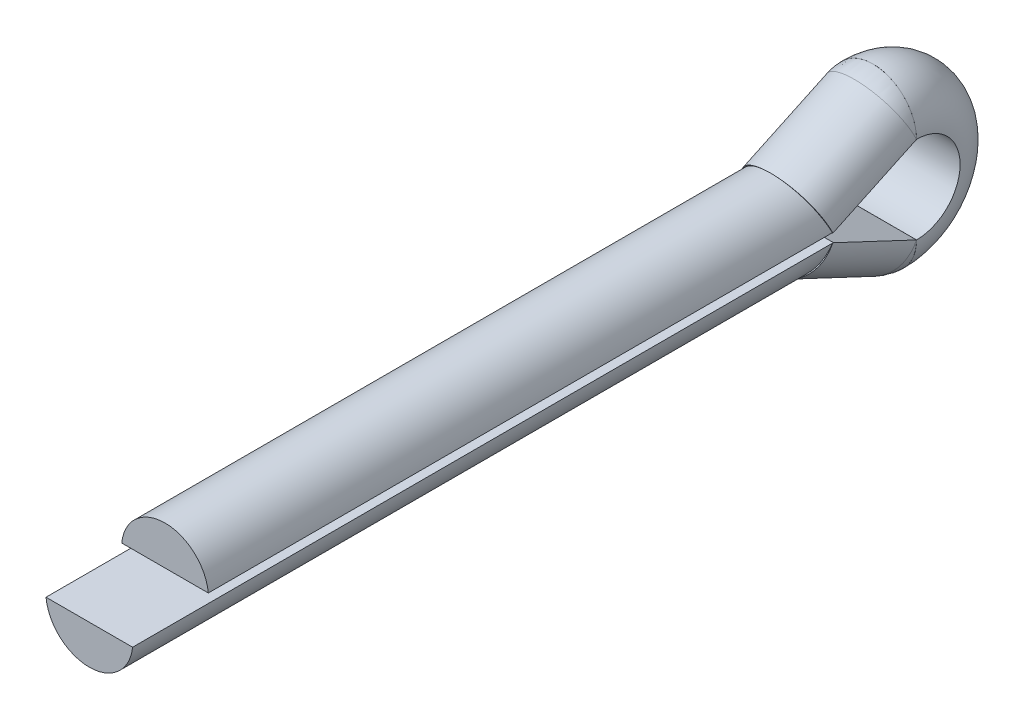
ISO-10303-21;
HEADER;
FILE_DESCRIPTION(('STEP AP214'),'2;1');
FILE_NAME('part.step','',(''),(''),'','','');
FILE_SCHEMA(('AUTOMOTIVE_DESIGN { 1 0 10303 214 1 1 1 1 }'));
ENDSEC;
DATA;
#1=APPLICATION_CONTEXT('core data for automotive mechanical design processes');
#2=APPLICATION_PROTOCOL_DEFINITION('international standard','automotive_design',2000,#1);
#3=PRODUCT_CONTEXT('',#1,'mechanical');
#4=PRODUCT('Part','Part','',(#3));
#5=PRODUCT_RELATED_PRODUCT_CATEGORY('part','',(#4));
#6=PRODUCT_DEFINITION_FORMATION('','',#4);
#7=PRODUCT_DEFINITION_CONTEXT('part definition',#1,'design');
#8=PRODUCT_DEFINITION('design','',#6,#7);
#9=PRODUCT_DEFINITION_SHAPE('','',#8);
#10=(LENGTH_UNIT() NAMED_UNIT(*) SI_UNIT(.MILLI.,.METRE.));
#11=(NAMED_UNIT(*) PLANE_ANGLE_UNIT() SI_UNIT($,.RADIAN.));
#12=(NAMED_UNIT(*) SI_UNIT($,.STERADIAN.) SOLID_ANGLE_UNIT());
#13=UNCERTAINTY_MEASURE_WITH_UNIT(LENGTH_MEASURE(1.E-05),#10,'distance_accuracy_value','');
#14=(GEOMETRIC_REPRESENTATION_CONTEXT(3) GLOBAL_UNCERTAINTY_ASSIGNED_CONTEXT((#13)) GLOBAL_UNIT_ASSIGNED_CONTEXT((#10,
#11,#12)) REPRESENTATION_CONTEXT('',''));
#15=CARTESIAN_POINT('',(0.,0.,0.));
#16=DIRECTION('',(0.,0.,1.));
#17=DIRECTION('',(1.,0.,0.));
#18=AXIS2_PLACEMENT_3D('',#15,#16,#17);
#19=CARTESIAN_POINT('',(0.,0.,32.));
#20=DIRECTION('',(0.,0.,-1.));
#21=DIRECTION('',(-1.,0.,0.));
#22=AXIS2_PLACEMENT_3D('',#19,#20,#21);
#23=CYLINDRICAL_SURFACE('',#22,2.3);
#24=CARTESIAN_POINT('',(0.,0.,36.));
#25=DIRECTION('',(0.,0.,1.));
#26=DIRECTION('',(-1.,0.,0.));
#27=AXIS2_PLACEMENT_3D('',#24,#25,#26);
#28=CIRCLE('',#27,2.3);
#29=CARTESIAN_POINT('',(-2.28748750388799,-0.239584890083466,36.));
#30=VERTEX_POINT('',#29);
#31=CARTESIAN_POINT('',(2.28748750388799,-0.239584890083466,36.));
#32=VERTEX_POINT('',#31);
#33=EDGE_CURVE('E178',#30,#32,#28,.T.);
#34=ORIENTED_EDGE('',*,*,#33,.F.);
#35=DIRECTION('',(0.,0.,-1.));
#36=VECTOR('',#35,1.);
#37=CARTESIAN_POINT('',(-2.28748750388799,-0.239584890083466,32.));
#38=LINE('',#37,#36);
#39=CARTESIAN_POINT('',(-2.28748750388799,-0.239584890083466,-0.969965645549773));
#40=VERTEX_POINT('',#39);
#41=EDGE_CURVE('E49',#30,#40,#38,.T.);
#42=ORIENTED_EDGE('',*,*,#41,.T.);
#43=CARTESIAN_POINT('',(0.,0.,-1.08275316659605));
#44=DIRECTION('',(0.,0.425925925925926,0.904758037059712));
#45=DIRECTION('',(0.,0.904758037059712,-0.425925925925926));
#46=AXIS2_PLACEMENT_3D('',#43,#44,#45);
#47=ELLIPSE('',#46,2.54211613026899,2.3);
#48=CARTESIAN_POINT('',(2.28748750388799,-0.239584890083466,-0.969965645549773));
#49=VERTEX_POINT('',#48);
#50=EDGE_CURVE('E175',#49,#40,#47,.F.);
#51=ORIENTED_EDGE('',*,*,#50,.F.);
#52=DIRECTION('',(0.,0.,-1.));
#53=VECTOR('',#52,1.);
#54=CARTESIAN_POINT('',(2.28748750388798,-0.23958489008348,32.));
#55=LINE('',#54,#53);
#56=EDGE_CURVE('E169',#49,#32,#55,.F.);
#57=ORIENTED_EDGE('',*,*,#56,.T.);
#58=EDGE_LOOP('',(#34,#42,#51,#57));
#59=FACE_BOUND('',#58,.T.);
#60=ADVANCED_FACE('F16',(#59),#23,.T.);
#61=CARTESIAN_POINT('',(0.,0.,32.));
#62=DIRECTION('',(0.,0.,1.));
#63=DIRECTION('',(1.,0.,0.));
#64=AXIS2_PLACEMENT_3D('',#61,#62,#63);
#65=PLANE('',#64);
#66=DIRECTION('',(-1.,0.,0.));
#67=VECTOR('',#66,1.);
#68=CARTESIAN_POINT('',(0.,0.239584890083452,32.));
#69=LINE('',#68,#67);
#70=CARTESIAN_POINT('',(2.28748750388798,0.239584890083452,32.));
#71=VERTEX_POINT('',#70);
#72=CARTESIAN_POINT('',(-2.28748750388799,0.239584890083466,32.));
#73=VERTEX_POINT('',#72);
#74=EDGE_CURVE('E328',#71,#73,#69,.T.);
#75=ORIENTED_EDGE('',*,*,#74,.F.);
#76=CARTESIAN_POINT('',(0.,0.,32.));
#77=DIRECTION('',(0.,0.,1.));
#78=DIRECTION('',(1.,0.,0.));
#79=AXIS2_PLACEMENT_3D('',#76,#77,#78);
#80=CIRCLE('',#79,2.3);
#81=EDGE_CURVE('E283',#71,#73,#80,.T.);
#82=ORIENTED_EDGE('',*,*,#81,.T.);
#83=EDGE_LOOP('',(#75,#82));
#84=FACE_BOUND('',#83,.T.);
#85=ADVANCED_FACE('F349',(#84),#65,.T.);
#86=CARTESIAN_POINT('',(2.299,-0.219961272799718,-0.979203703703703));
#87=DIRECTION('',(0.,-0.904758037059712,0.425925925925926));
#88=DIRECTION('',(0.,0.425925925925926,0.904758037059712));
#89=AXIS2_PLACEMENT_3D('',#86,#87,#88);
#90=PLANE('',#89);
#91=DIRECTION('',(0.,-0.425925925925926,-0.904758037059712));
#92=VECTOR('',#91,1.);
#93=CARTESIAN_POINT('',(-2.301,-0.219961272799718,-0.979203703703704));
#94=LINE('',#93,#92);
#95=CARTESIAN_POINT('',(-2.301,-0.239584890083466,-1.02088847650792));
#96=VERTEX_POINT('',#95);
#97=CARTESIAN_POINT('',(-2.301,-2.30090475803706,-5.39957407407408));
#98=VERTEX_POINT('',#97);
#99=EDGE_CURVE('E205',#96,#98,#94,.T.);
#100=ORIENTED_EDGE('',*,*,#99,.F.);
#101=DIRECTION('',(1.,0.,0.));
#102=VECTOR('',#101,1.);
#103=CARTESIAN_POINT('',(2.299,-0.239584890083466,-1.02088847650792));
#104=LINE('',#103,#102);
#105=CARTESIAN_POINT('',(2.299,-0.239584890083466,-1.02088847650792));
#106=VERTEX_POINT('',#105);
#107=EDGE_CURVE('E316',#96,#106,#104,.T.);
#108=ORIENTED_EDGE('',*,*,#107,.T.);
#109=DIRECTION('',(0.,-0.425925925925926,-0.904758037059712));
#110=VECTOR('',#109,1.);
#111=CARTESIAN_POINT('',(2.299,-0.219961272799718,-0.979203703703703));
#112=LINE('',#111,#110);
#113=CARTESIAN_POINT('',(2.299,-2.30090475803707,-5.39957407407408));
#114=VERTEX_POINT('',#113);
#115=EDGE_CURVE('E208',#106,#114,#112,.T.);
#116=ORIENTED_EDGE('',*,*,#115,.T.);
#117=DIRECTION('',(-1.,0.,0.));
#118=VECTOR('',#117,1.);
#119=CARTESIAN_POINT('',(2.299,-2.30090475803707,-5.39957407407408));
#120=LINE('',#119,#118);
#121=CARTESIAN_POINT('',(2.29769978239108,-2.30090475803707,-5.39957407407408));
#122=VERTEX_POINT('',#121);
#123=EDGE_CURVE('E198',#114,#122,#120,.T.);
#124=ORIENTED_EDGE('',*,*,#123,.T.);
#125=DIRECTION('',(1.,0.,0.));
#126=VECTOR('',#125,1.);
#127=CARTESIAN_POINT('',(0.,-2.30090475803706,-5.39957407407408));
#128=LINE('',#127,#126);
#129=CARTESIAN_POINT('',(-2.29769978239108,-2.30090475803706,-5.39957407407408));
#130=VERTEX_POINT('',#129);
#131=EDGE_CURVE('E291',#130,#122,#128,.T.);
#132=ORIENTED_EDGE('',*,*,#131,.F.);
#133=EDGE_CURVE('E190',#130,#98,#120,.T.);
#134=ORIENTED_EDGE('',*,*,#133,.T.);
#135=EDGE_LOOP('',(#100,#108,#116,#124,#132,#134));
#136=FACE_BOUND('',#135,.T.);
#137=ADVANCED_FACE('F351',(#136),#90,.F.);
#138=CARTESIAN_POINT('',(-0.000999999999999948,-0.219961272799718,-0.979203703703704));
#139=DIRECTION('',(0.,0.425925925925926,0.904758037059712));
#140=DIRECTION('',(-1.,0.,0.));
#141=AXIS2_PLACEMENT_3D('',#138,#139,#140);
#142=PLANE('',#141);
#143=DIRECTION('',(1.,0.,0.));
#144=VECTOR('',#143,1.);
#145=CARTESIAN_POINT('',(-0.00100000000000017,-0.239584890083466,-0.969965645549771));
#146=LINE('',#145,#144);
#147=CARTESIAN_POINT('',(-2.30089773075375,-0.239584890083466,-0.969965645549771));
#148=VERTEX_POINT('',#147);
#149=EDGE_CURVE('E300',#148,#40,#146,.T.);
#150=ORIENTED_EDGE('',*,*,#149,.F.);
#151=CARTESIAN_POINT('',(-0.000999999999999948,-0.219961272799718,-0.979203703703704));
#152=DIRECTION('',(0.,0.425925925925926,0.904758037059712));
#153=DIRECTION('',(-1.,0.,0.));
#154=AXIS2_PLACEMENT_3D('',#151,#152,#153);
#155=CIRCLE('',#154,2.3);
#156=CARTESIAN_POINT('',(2.29889773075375,-0.239584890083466,-0.969965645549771));
#157=VERTEX_POINT('',#156);
#158=EDGE_CURVE('E200',#148,#157,#155,.T.);
#159=ORIENTED_EDGE('',*,*,#158,.T.);
#160=EDGE_CURVE('E302',#49,#157,#146,.T.);
#161=ORIENTED_EDGE('',*,*,#160,.F.);
#162=ORIENTED_EDGE('',*,*,#50,.T.);
#163=EDGE_LOOP('',(#150,#159,#161,#162));
#164=FACE_BOUND('',#163,.T.);
#165=ADVANCED_FACE('F299',(#164),#142,.T.);
#166=CARTESIAN_POINT('',(0.,-2.3,-5.4));
#167=DIRECTION('',(0.,0.425925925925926,0.904758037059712));
#168=DIRECTION('',(-1.,0.,0.));
#169=AXIS2_PLACEMENT_3D('',#166,#167,#168);
#170=PLANE('',#169);
#171=CARTESIAN_POINT('',(0.,-2.3,-5.4));
#172=DIRECTION('',(0.,0.425925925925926,0.904758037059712));
#173=DIRECTION('',(-1.,0.,0.));
#174=AXIS2_PLACEMENT_3D('',#171,#172,#173);
#175=CIRCLE('',#174,2.2977);
#176=CARTESIAN_POINT('',(-2.2977,-2.3,-5.4));
#177=VERTEX_POINT('',#176);
#178=EDGE_CURVE('E221',#177,#130,#175,.T.);
#179=ORIENTED_EDGE('',*,*,#178,.T.);
#180=ORIENTED_EDGE('',*,*,#131,.T.);
#181=CARTESIAN_POINT('',(2.2977,-2.30000000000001,-5.4));
#182=VERTEX_POINT('',#181);
#183=EDGE_CURVE('E215',#122,#182,#175,.T.);
#184=ORIENTED_EDGE('',*,*,#183,.T.);
#185=DIRECTION('',(-1.,0.,0.));
#186=VECTOR('',#185,1.);
#187=CARTESIAN_POINT('',(2.2977,-2.30000000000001,-5.4));
#188=LINE('',#187,#186);
#189=EDGE_CURVE('E216',#182,#177,#188,.T.);
#190=ORIENTED_EDGE('',*,*,#189,.T.);
#191=EDGE_LOOP('',(#179,#180,#184,#190));
#192=FACE_BOUND('',#191,.T.);
#193=ADVANCED_FACE('F392',(#192),#170,.T.);
#194=CARTESIAN_POINT('',(0.,-2.3,-5.4));
#195=DIRECTION('',(0.,0.,-1.));
#196=DIRECTION('',(1.,0.,0.));
#197=AXIS2_PLACEMENT_3D('',#194,#195,#196);
#198=PLANE('',#197);
#199=CARTESIAN_POINT('',(0.,-2.3,-5.4));
#200=DIRECTION('',(0.,0.,1.));
#201=DIRECTION('',(-1.,0.,0.));
#202=AXIS2_PLACEMENT_3D('',#199,#200,#201);
#203=CIRCLE('',#202,2.2977);
#204=EDGE_CURVE('E211',#177,#182,#203,.T.);
#205=ORIENTED_EDGE('',*,*,#204,.F.);
#206=DIRECTION('',(1.,0.,0.));
#207=VECTOR('',#206,1.);
#208=CARTESIAN_POINT('',(-2.3,-2.3,-5.4));
#209=LINE('',#208,#207);
#210=CARTESIAN_POINT('',(-2.3,-2.3,-5.4));
#211=VERTEX_POINT('',#210);
#212=EDGE_CURVE('E235',#211,#177,#209,.T.);
#213=ORIENTED_EDGE('',*,*,#212,.F.);
#214=CARTESIAN_POINT('',(0.,-2.3,-5.4));
#215=DIRECTION('',(0.,0.,-1.));
#216=DIRECTION('',(1.,0.,0.));
#217=AXIS2_PLACEMENT_3D('',#214,#215,#216);
#218=CIRCLE('',#217,2.3);
#219=CARTESIAN_POINT('',(2.3,-2.30000000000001,-5.4));
#220=VERTEX_POINT('',#219);
#221=EDGE_CURVE('E230',#220,#211,#218,.T.);
#222=ORIENTED_EDGE('',*,*,#221,.F.);
#223=EDGE_CURVE('E240',#182,#220,#209,.T.);
#224=ORIENTED_EDGE('',*,*,#223,.F.);
#225=EDGE_LOOP('',(#205,#213,#222,#224));
#226=FACE_BOUND('',#225,.T.);
#227=ADVANCED_FACE('F389',(#226),#198,.F.);
#228=ORIENTED_EDGE('',*,*,#81,.F.);
#229=DIRECTION('',(0.,0.,-1.));
#230=VECTOR('',#229,1.);
#231=CARTESIAN_POINT('',(2.28748750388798,0.239584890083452,32.));
#232=LINE('',#231,#230);
#233=CARTESIAN_POINT('',(2.28748750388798,0.239584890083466,-0.969965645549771));
#234=VERTEX_POINT('',#233);
#235=EDGE_CURVE('E325',#71,#234,#232,.T.);
#236=ORIENTED_EDGE('',*,*,#235,.T.);
#237=CARTESIAN_POINT('',(0.,0.,-1.08275316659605));
#238=DIRECTION('',(0.,-0.425925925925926,0.904758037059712));
#239=DIRECTION('',(0.,-0.904758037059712,-0.425925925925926));
#240=AXIS2_PLACEMENT_3D('',#237,#238,#239);
#241=ELLIPSE('',#240,2.54211613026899,2.3);
#242=CARTESIAN_POINT('',(-2.28748750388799,0.239584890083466,-0.969965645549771));
#243=VERTEX_POINT('',#242);
#244=EDGE_CURVE('E287',#234,#243,#241,.T.);
#245=ORIENTED_EDGE('',*,*,#244,.T.);
#246=DIRECTION('',(0.,0.,-1.));
#247=VECTOR('',#246,1.);
#248=CARTESIAN_POINT('',(-2.28748750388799,0.239584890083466,32.));
#249=LINE('',#248,#247);
#250=EDGE_CURVE('E184',#243,#73,#249,.F.);
#251=ORIENTED_EDGE('',*,*,#250,.T.);
#252=EDGE_LOOP('',(#228,#236,#245,#251));
#253=FACE_BOUND('',#252,.T.);
#254=ADVANCED_FACE('F18',(#253),#23,.T.);
#255=CARTESIAN_POINT('',(0.000999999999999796,0.219961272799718,-0.979203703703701));
#256=DIRECTION('',(0.,-0.425925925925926,0.904758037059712));
#257=DIRECTION('',(1.,0.,0.));
#258=AXIS2_PLACEMENT_3D('',#255,#256,#257);
#259=PLANE('',#258);
#260=DIRECTION('',(-1.,0.,0.));
#261=VECTOR('',#260,1.);
#262=CARTESIAN_POINT('',(0.00100000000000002,0.239584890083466,-0.969965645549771));
#263=LINE('',#262,#261);
#264=CARTESIAN_POINT('',(2.30089773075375,0.239584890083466,-0.969965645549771));
#265=VERTEX_POINT('',#264);
#266=EDGE_CURVE('E322',#265,#234,#263,.T.);
#267=ORIENTED_EDGE('',*,*,#266,.F.);
#268=CARTESIAN_POINT('',(0.000999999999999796,0.219961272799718,-0.979203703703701));
#269=DIRECTION('',(0.,-0.425925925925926,0.904758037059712));
#270=DIRECTION('',(1.,0.,0.));
#271=AXIS2_PLACEMENT_3D('',#268,#269,#270);
#272=CIRCLE('',#271,2.3);
#273=CARTESIAN_POINT('',(-2.29889773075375,0.239584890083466,-0.969965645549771));
#274=VERTEX_POINT('',#273);
#275=EDGE_CURVE('E269',#265,#274,#272,.T.);
#276=ORIENTED_EDGE('',*,*,#275,.T.);
#277=EDGE_CURVE('E194',#243,#274,#263,.T.);
#278=ORIENTED_EDGE('',*,*,#277,.F.);
#279=ORIENTED_EDGE('',*,*,#244,.F.);
#280=EDGE_LOOP('',(#267,#276,#278,#279));
#281=FACE_BOUND('',#280,.T.);
#282=ADVANCED_FACE('F345',(#281),#259,.T.);
#283=CARTESIAN_POINT('',(-2.299,0.219961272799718,-0.979203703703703));
#284=DIRECTION('',(0.,0.904758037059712,0.425925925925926));
#285=DIRECTION('',(0.,-0.425925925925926,0.904758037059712));
#286=AXIS2_PLACEMENT_3D('',#283,#284,#285);
#287=PLANE('',#286);
#288=DIRECTION('',(0.,0.425925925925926,-0.904758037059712));
#289=VECTOR('',#288,1.);
#290=CARTESIAN_POINT('',(2.301,0.219961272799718,-0.979203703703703));
#291=LINE('',#290,#289);
#292=CARTESIAN_POINT('',(2.301,0.239584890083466,-1.02088847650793));
#293=VERTEX_POINT('',#292);
#294=CARTESIAN_POINT('',(2.301,2.30090475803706,-5.39957407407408));
#295=VERTEX_POINT('',#294);
#296=EDGE_CURVE('E278',#293,#295,#291,.T.);
#297=ORIENTED_EDGE('',*,*,#296,.F.);
#298=DIRECTION('',(-1.,0.,0.));
#299=VECTOR('',#298,1.);
#300=CARTESIAN_POINT('',(-2.299,0.239584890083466,-1.02088847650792));
#301=LINE('',#300,#299);
#302=CARTESIAN_POINT('',(-2.299,0.239584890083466,-1.02088847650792));
#303=VERTEX_POINT('',#302);
#304=EDGE_CURVE('E37',#293,#303,#301,.T.);
#305=ORIENTED_EDGE('',*,*,#304,.T.);
#306=DIRECTION('',(0.,0.425925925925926,-0.904758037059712));
#307=VECTOR('',#306,1.);
#308=CARTESIAN_POINT('',(-2.299,0.219961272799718,-0.979203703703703));
#309=LINE('',#308,#307);
#310=CARTESIAN_POINT('',(-2.299,2.30090475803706,-5.39957407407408));
#311=VERTEX_POINT('',#310);
#312=EDGE_CURVE('E280',#303,#311,#309,.T.);
#313=ORIENTED_EDGE('',*,*,#312,.T.);
#314=DIRECTION('',(1.,0.,0.));
#315=VECTOR('',#314,1.);
#316=CARTESIAN_POINT('',(-2.299,2.30090475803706,-5.39957407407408));
#317=LINE('',#316,#315);
#318=CARTESIAN_POINT('',(-2.29769978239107,2.30090475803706,-5.39957407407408));
#319=VERTEX_POINT('',#318);
#320=EDGE_CURVE('E265',#311,#319,#317,.T.);
#321=ORIENTED_EDGE('',*,*,#320,.T.);
#322=CARTESIAN_POINT('',(2.29769978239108,2.30090475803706,-5.39957407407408));
#323=VERTEX_POINT('',#322);
#324=EDGE_CURVE('E270',#319,#323,#317,.T.);
#325=ORIENTED_EDGE('',*,*,#324,.T.);
#326=EDGE_CURVE('E271',#323,#295,#317,.T.);
#327=ORIENTED_EDGE('',*,*,#326,.T.);
#328=EDGE_LOOP('',(#297,#305,#313,#321,#325,#327));
#329=FACE_BOUND('',#328,.T.);
#330=ADVANCED_FACE('F362',(#329),#287,.F.);
#331=CARTESIAN_POINT('',(0.000999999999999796,0.219961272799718,-0.979203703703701));
#332=DIRECTION('',(0.,0.425925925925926,-0.904758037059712));
#333=DIRECTION('',(-1.,0.,0.));
#334=AXIS2_PLACEMENT_3D('',#331,#332,#333);
#335=CYLINDRICAL_SURFACE('',#334,2.3);
#336=ORIENTED_EDGE('',*,*,#312,.F.);
#337=CARTESIAN_POINT('',(0.000999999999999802,0.239584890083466,-1.02088847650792));
#338=DIRECTION('',(0.,1.,0.));
#339=DIRECTION('',(0.,0.,-1.));
#340=AXIS2_PLACEMENT_3D('',#337,#338,#339);
#341=ELLIPSE('',#340,5.4,2.3);
#342=EDGE_CURVE('E11',#303,#274,#341,.T.);
#343=ORIENTED_EDGE('',*,*,#342,.T.);
#344=ORIENTED_EDGE('',*,*,#275,.F.);
#345=EDGE_CURVE('E20',#265,#293,#341,.T.);
#346=ORIENTED_EDGE('',*,*,#345,.T.);
#347=ORIENTED_EDGE('',*,*,#296,.T.);
#348=CARTESIAN_POINT('',(0.000999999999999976,2.30090475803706,-5.39957407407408));
#349=DIRECTION('',(0.,-0.425925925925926,0.904758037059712));
#350=DIRECTION('',(1.,0.,0.));
#351=AXIS2_PLACEMENT_3D('',#348,#349,#350);
#352=CIRCLE('',#351,2.3);
#353=EDGE_CURVE('E259',#295,#311,#352,.T.);
#354=ORIENTED_EDGE('',*,*,#353,.T.);
#355=EDGE_LOOP('',(#336,#343,#344,#346,#347,#354));
#356=FACE_BOUND('',#355,.T.);
#357=ADVANCED_FACE('F343',(#356),#335,.T.);
#358=CARTESIAN_POINT('',(0.000999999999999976,2.30090475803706,-5.39957407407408));
#359=DIRECTION('',(0.,-0.425925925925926,0.904758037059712));
#360=DIRECTION('',(1.,0.,0.));
#361=AXIS2_PLACEMENT_3D('',#358,#359,#360);
#362=PLANE('',#361);
#363=ORIENTED_EDGE('',*,*,#326,.F.);
#364=CARTESIAN_POINT('',(0.,2.3,-5.4));
#365=DIRECTION('',(0.,-0.425925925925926,0.904758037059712));
#366=DIRECTION('',(1.,0.,0.));
#367=AXIS2_PLACEMENT_3D('',#364,#365,#366);
#368=CIRCLE('',#367,2.2977);
#369=EDGE_CURVE('E264',#323,#319,#368,.T.);
#370=ORIENTED_EDGE('',*,*,#369,.T.);
#371=ORIENTED_EDGE('',*,*,#320,.F.);
#372=ORIENTED_EDGE('',*,*,#353,.F.);
#373=EDGE_LOOP('',(#363,#370,#371,#372));
#374=FACE_BOUND('',#373,.T.);
#375=ADVANCED_FACE('F361',(#374),#362,.F.);
#376=CARTESIAN_POINT('',(0.,2.3,-5.4));
#377=DIRECTION('',(0.,-0.425925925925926,0.904758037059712));
#378=DIRECTION('',(1.,0.,0.));
#379=AXIS2_PLACEMENT_3D('',#376,#377,#378);
#380=PLANE('',#379);
#381=ORIENTED_EDGE('',*,*,#324,.F.);
#382=CARTESIAN_POINT('',(-2.2977,2.3,-5.4));
#383=VERTEX_POINT('',#382);
#384=EDGE_CURVE('E254',#319,#383,#368,.T.);
#385=ORIENTED_EDGE('',*,*,#384,.T.);
#386=DIRECTION('',(1.,0.,0.));
#387=VECTOR('',#386,1.);
#388=CARTESIAN_POINT('',(-2.2977,2.3,-5.4));
#389=LINE('',#388,#387);
#390=CARTESIAN_POINT('',(2.2977,2.29999999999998,-5.4));
#391=VERTEX_POINT('',#390);
#392=EDGE_CURVE('E255',#383,#391,#389,.T.);
#393=ORIENTED_EDGE('',*,*,#392,.T.);
#394=EDGE_CURVE('E260',#391,#323,#368,.T.);
#395=ORIENTED_EDGE('',*,*,#394,.T.);
#396=EDGE_LOOP('',(#381,#385,#393,#395));
#397=FACE_BOUND('',#396,.T.);
#398=ADVANCED_FACE('F370',(#397),#380,.T.);
#399=CARTESIAN_POINT('',(0.,2.3,-5.4));
#400=DIRECTION('',(-1.,0.,0.));
#401=DIRECTION('',(0.,0.904758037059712,0.425925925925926));
#402=AXIS2_PLACEMENT_3D('',#399,#400,#401);
#403=SPHERICAL_SURFACE('',#402,2.2977);
#404=CARTESIAN_POINT('',(0.,2.3,-5.4));
#405=DIRECTION('',(0.,0.,1.));
#406=DIRECTION('',(1.,0.,0.));
#407=AXIS2_PLACEMENT_3D('',#404,#405,#406);
#408=CIRCLE('',#407,2.2977);
#409=EDGE_CURVE('E250',#391,#383,#408,.T.);
#410=ORIENTED_EDGE('',*,*,#409,.T.);
#411=ORIENTED_EDGE('',*,*,#384,.F.);
#412=ORIENTED_EDGE('',*,*,#369,.F.);
#413=ORIENTED_EDGE('',*,*,#394,.F.);
#414=EDGE_LOOP('',(#410,#411,#412,#413));
#415=FACE_BOUND('',#414,.T.);
#416=ADVANCED_FACE('F372',(#415),#403,.T.);
#417=CARTESIAN_POINT('',(0.,2.3,-5.4));
#418=DIRECTION('',(0.,0.,1.));
#419=DIRECTION('',(1.,0.,0.));
#420=AXIS2_PLACEMENT_3D('',#417,#418,#419);
#421=PLANE('',#420);
#422=ORIENTED_EDGE('',*,*,#409,.F.);
#423=DIRECTION('',(1.,0.,0.));
#424=VECTOR('',#423,1.);
#425=CARTESIAN_POINT('',(-2.3,2.3,-5.4));
#426=LINE('',#425,#424);
#427=CARTESIAN_POINT('',(2.3,2.29999999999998,-5.4));
#428=VERTEX_POINT('',#427);
#429=EDGE_CURVE('E231',#391,#428,#426,.T.);
#430=ORIENTED_EDGE('',*,*,#429,.T.);
#431=CARTESIAN_POINT('',(0.,2.3,-5.4));
#432=DIRECTION('',(0.,0.,1.));
#433=DIRECTION('',(1.,0.,0.));
#434=AXIS2_PLACEMENT_3D('',#431,#432,#433);
#435=CIRCLE('',#434,2.3);
#436=CARTESIAN_POINT('',(-2.3,2.3,-5.4));
#437=VERTEX_POINT('',#436);
#438=EDGE_CURVE('E220',#428,#437,#435,.T.);
#439=ORIENTED_EDGE('',*,*,#438,.T.);
#440=EDGE_CURVE('E226',#437,#383,#426,.T.);
#441=ORIENTED_EDGE('',*,*,#440,.T.);
#442=EDGE_LOOP('',(#422,#430,#439,#441));
#443=FACE_BOUND('',#442,.T.);
#444=ADVANCED_FACE('F375',(#443),#421,.T.);
#445=CARTESIAN_POINT('',(0.,0.,-5.4));
#446=DIRECTION('',(1.,0.,0.));
#447=DIRECTION('',(0.,0.,-1.));
#448=AXIS2_PLACEMENT_3D('',#445,#446,#447);
#449=DEGENERATE_TOROIDAL_SURFACE('',#448,2.3,2.3,.T.);
#450=CARTESIAN_POINT('',(-2.3,0.,-5.4));
#451=DIRECTION('',(1.,0.,0.));
#452=DIRECTION('',(0.,0.,-1.));
#453=AXIS2_PLACEMENT_3D('',#450,#451,#452);
#454=CIRCLE('',#453,2.3);
#455=EDGE_CURVE('E247',#211,#437,#454,.T.);
#456=ORIENTED_EDGE('',*,*,#455,.T.);
#457=ORIENTED_EDGE('',*,*,#438,.F.);
#458=CARTESIAN_POINT('',(2.3,0.,-5.4));
#459=DIRECTION('',(1.,0.,0.));
#460=DIRECTION('',(0.,0.,-1.));
#461=AXIS2_PLACEMENT_3D('',#458,#459,#460);
#462=CIRCLE('',#461,2.3);
#463=EDGE_CURVE('E239',#220,#428,#462,.T.);
#464=ORIENTED_EDGE('',*,*,#463,.F.);
#465=ORIENTED_EDGE('',*,*,#221,.T.);
#466=EDGE_LOOP('',(#456,#457,#464,#465));
#467=FACE_BOUND('',#466,.T.);
#468=ADVANCED_FACE('F384',(#467),#449,.T.);
#469=CARTESIAN_POINT('',(1.,0.,-5.4));
#470=DIRECTION('',(1.,0.,0.));
#471=DIRECTION('',(0.,0.,-1.));
#472=AXIS2_PLACEMENT_3D('',#469,#470,#471);
#473=CYLINDRICAL_SURFACE('',#472,2.3);
#474=ORIENTED_EDGE('',*,*,#212,.T.);
#475=ORIENTED_EDGE('',*,*,#189,.F.);
#476=ORIENTED_EDGE('',*,*,#223,.T.);
#477=ORIENTED_EDGE('',*,*,#463,.T.);
#478=ORIENTED_EDGE('',*,*,#429,.F.);
#479=ORIENTED_EDGE('',*,*,#392,.F.);
#480=ORIENTED_EDGE('',*,*,#440,.F.);
#481=ORIENTED_EDGE('',*,*,#455,.F.);
#482=EDGE_LOOP('',(#474,#475,#476,#477,#478,#479,#480,#481));
#483=FACE_BOUND('',#482,.T.);
#484=ADVANCED_FACE('F380',(#483),#473,.F.);
#485=CARTESIAN_POINT('',(0.,-2.3,-5.4));
#486=DIRECTION('',(1.,0.,0.));
#487=DIRECTION('',(0.,-0.904758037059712,0.425925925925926));
#488=AXIS2_PLACEMENT_3D('',#485,#486,#487);
#489=SPHERICAL_SURFACE('',#488,2.2977);
#490=ORIENTED_EDGE('',*,*,#204,.T.);
#491=ORIENTED_EDGE('',*,*,#183,.F.);
#492=EDGE_CURVE('E225',#130,#122,#175,.T.);
#493=ORIENTED_EDGE('',*,*,#492,.F.);
#494=ORIENTED_EDGE('',*,*,#178,.F.);
#495=EDGE_LOOP('',(#490,#491,#493,#494));
#496=FACE_BOUND('',#495,.T.);
#497=ADVANCED_FACE('F383',(#496),#489,.T.);
#498=CARTESIAN_POINT('',(-0.00100000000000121,-2.30090475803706,-5.39957407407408));
#499=DIRECTION('',(0.,0.425925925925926,0.904758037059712));
#500=DIRECTION('',(-1.,0.,0.));
#501=AXIS2_PLACEMENT_3D('',#498,#499,#500);
#502=PLANE('',#501);
#503=ORIENTED_EDGE('',*,*,#133,.F.);
#504=ORIENTED_EDGE('',*,*,#492,.T.);
#505=ORIENTED_EDGE('',*,*,#123,.F.);
#506=CARTESIAN_POINT('',(-0.00100000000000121,-2.30090475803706,-5.39957407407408));
#507=DIRECTION('',(0.,0.425925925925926,0.904758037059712));
#508=DIRECTION('',(-1.,0.,0.));
#509=AXIS2_PLACEMENT_3D('',#506,#507,#508);
#510=CIRCLE('',#509,2.3);
#511=EDGE_CURVE('E183',#98,#114,#510,.T.);
#512=ORIENTED_EDGE('',*,*,#511,.F.);
#513=EDGE_LOOP('',(#503,#504,#505,#512));
#514=FACE_BOUND('',#513,.T.);
#515=ADVANCED_FACE('F399',(#514),#502,.F.);
#516=CARTESIAN_POINT('',(-0.000999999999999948,-0.219961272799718,-0.979203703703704));
#517=DIRECTION('',(0.,-0.425925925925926,-0.904758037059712));
#518=DIRECTION('',(1.,0.,0.));
#519=AXIS2_PLACEMENT_3D('',#516,#517,#518);
#520=CYLINDRICAL_SURFACE('',#519,2.3);
#521=ORIENTED_EDGE('',*,*,#115,.F.);
#522=CARTESIAN_POINT('',(-0.000999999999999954,-0.239584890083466,-1.02088847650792));
#523=DIRECTION('',(0.,-1.,0.));
#524=DIRECTION('',(0.,0.,-1.));
#525=AXIS2_PLACEMENT_3D('',#522,#523,#524);
#526=ELLIPSE('',#525,5.4,2.3);
#527=EDGE_CURVE('E315',#106,#157,#526,.T.);
#528=ORIENTED_EDGE('',*,*,#527,.T.);
#529=ORIENTED_EDGE('',*,*,#158,.F.);
#530=EDGE_CURVE('E309',#148,#96,#526,.T.);
#531=ORIENTED_EDGE('',*,*,#530,.T.);
#532=ORIENTED_EDGE('',*,*,#99,.T.);
#533=ORIENTED_EDGE('',*,*,#511,.T.);
#534=EDGE_LOOP('',(#521,#528,#529,#531,#532,#533));
#535=FACE_BOUND('',#534,.T.);
#536=ADVANCED_FACE('F404',(#535),#520,.T.);
#537=CARTESIAN_POINT('',(0.,0.,36.));
#538=DIRECTION('',(0.,0.,1.));
#539=DIRECTION('',(-1.,0.,0.));
#540=AXIS2_PLACEMENT_3D('',#537,#538,#539);
#541=PLANE('',#540);
#542=DIRECTION('',(1.,0.,0.));
#543=VECTOR('',#542,1.);
#544=CARTESIAN_POINT('',(0.,-0.239584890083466,36.));
#545=LINE('',#544,#543);
#546=EDGE_CURVE('E166',#30,#32,#545,.T.);
#547=ORIENTED_EDGE('',*,*,#546,.F.);
#548=ORIENTED_EDGE('',*,*,#33,.T.);
#549=EDGE_LOOP('',(#547,#548));
#550=FACE_BOUND('',#549,.T.);
#551=ADVANCED_FACE('F182',(#550),#541,.T.);
#552=CARTESIAN_POINT('',(4.6,-0.23958489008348,27.));
#553=DIRECTION('',(0.,-1.,0.));
#554=DIRECTION('',(1.,0.,0.));
#555=AXIS2_PLACEMENT_3D('',#552,#553,#554);
#556=PLANE('',#555);
#557=ORIENTED_EDGE('',*,*,#530,.F.);
#558=ORIENTED_EDGE('',*,*,#149,.T.);
#559=ORIENTED_EDGE('',*,*,#41,.F.);
#560=ORIENTED_EDGE('',*,*,#546,.T.);
#561=ORIENTED_EDGE('',*,*,#56,.F.);
#562=ORIENTED_EDGE('',*,*,#160,.T.);
#563=ORIENTED_EDGE('',*,*,#527,.F.);
#564=ORIENTED_EDGE('',*,*,#107,.F.);
#565=EDGE_LOOP('',(#557,#558,#559,#560,#561,#562,#563,#564));
#566=FACE_BOUND('',#565,.T.);
#567=ADVANCED_FACE('F168',(#566),#556,.F.);
#568=CARTESIAN_POINT('',(4.6,0.239584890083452,27.));
#569=DIRECTION('',(0.,1.,0.));
#570=DIRECTION('',(-1.,0.,0.));
#571=AXIS2_PLACEMENT_3D('',#568,#569,#570);
#572=PLANE('',#571);
#573=ORIENTED_EDGE('',*,*,#277,.T.);
#574=ORIENTED_EDGE('',*,*,#342,.F.);
#575=ORIENTED_EDGE('',*,*,#304,.F.);
#576=ORIENTED_EDGE('',*,*,#345,.F.);
#577=ORIENTED_EDGE('',*,*,#266,.T.);
#578=ORIENTED_EDGE('',*,*,#235,.F.);
#579=ORIENTED_EDGE('',*,*,#74,.T.);
#580=ORIENTED_EDGE('',*,*,#250,.F.);
#581=EDGE_LOOP('',(#573,#574,#575,#576,#577,#578,#579,#580));
#582=FACE_BOUND('',#581,.T.);
#583=ADVANCED_FACE('F337',(#582),#572,.F.);
#584=CLOSED_SHELL('',(#60,#85,#137,#165,#193,#227,#254,#282,#330,#357,#375,#398,#416,#444,#468,
#484,#497,#515,#536,#551,#567,#583));
#585=MANIFOLD_SOLID_BREP('B1',#584);
#586=ADVANCED_BREP_SHAPE_REPRESENTATION('',(#18,#585),#14);
#587=SHAPE_DEFINITION_REPRESENTATION(#9,#586);
ENDSEC;
END-ISO-10303-21;
